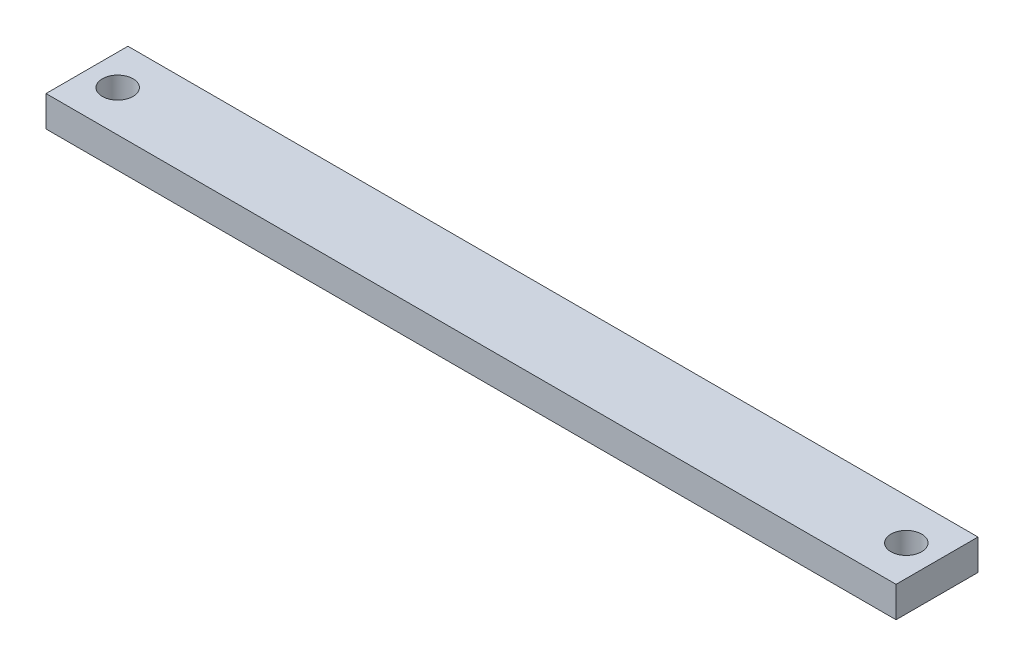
ISO-10303-21;
HEADER;
FILE_DESCRIPTION(('STEP AP214'),'2;1');
FILE_NAME('part.step','',(''),(''),'','','');
FILE_SCHEMA(('AUTOMOTIVE_DESIGN { 1 0 10303 214 1 1 1 1 }'));
ENDSEC;
DATA;
#1=APPLICATION_CONTEXT('core data for automotive mechanical design processes');
#2=APPLICATION_PROTOCOL_DEFINITION('international standard','automotive_design',2000,#1);
#3=PRODUCT_CONTEXT('',#1,'mechanical');
#4=PRODUCT('Part','Part','',(#3));
#5=PRODUCT_RELATED_PRODUCT_CATEGORY('part','',(#4));
#6=PRODUCT_DEFINITION_FORMATION('','',#4);
#7=PRODUCT_DEFINITION_CONTEXT('part definition',#1,'design');
#8=PRODUCT_DEFINITION('design','',#6,#7);
#9=PRODUCT_DEFINITION_SHAPE('','',#8);
#10=(LENGTH_UNIT() NAMED_UNIT(*) SI_UNIT(.MILLI.,.METRE.));
#11=(NAMED_UNIT(*) PLANE_ANGLE_UNIT() SI_UNIT($,.RADIAN.));
#12=(NAMED_UNIT(*) SI_UNIT($,.STERADIAN.) SOLID_ANGLE_UNIT());
#13=UNCERTAINTY_MEASURE_WITH_UNIT(LENGTH_MEASURE(1.E-05),#10,'distance_accuracy_value','');
#14=(GEOMETRIC_REPRESENTATION_CONTEXT(3) GLOBAL_UNCERTAINTY_ASSIGNED_CONTEXT((#13)) GLOBAL_UNIT_ASSIGNED_CONTEXT((#10,
#11,#12)) REPRESENTATION_CONTEXT('',''));
#15=CARTESIAN_POINT('',(0.,0.,0.));
#16=DIRECTION('',(0.,0.,1.));
#17=DIRECTION('',(1.,0.,0.));
#18=AXIS2_PLACEMENT_3D('',#15,#16,#17);
#19=CARTESIAN_POINT('',(-48.070148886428,3.,-8.));
#20=DIRECTION('',(0.,1.,0.));
#21=DIRECTION('',(0.,0.,1.));
#22=AXIS2_PLACEMENT_3D('',#19,#20,#21);
#23=PLANE('',#22);
#24=CARTESIAN_POINT('',(-45.070148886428,3.,-4.));
#25=DIRECTION('',(0.,1.,0.));
#26=DIRECTION('',(0.,0.,1.));
#27=AXIS2_PLACEMENT_3D('',#24,#25,#26);
#28=CIRCLE('',#27,1.5);
#29=CARTESIAN_POINT('',(-45.070148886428,3.,-2.5));
#30=VERTEX_POINT('',#29);
#31=EDGE_CURVE('E85',#30,#30,#28,.T.);
#32=ORIENTED_EDGE('',*,*,#31,.F.);
#33=EDGE_LOOP('',(#32));
#34=FACE_BOUND('',#33,.T.);
#35=DIRECTION('',(0.,0.,1.));
#36=VECTOR('',#35,1.);
#37=CARTESIAN_POINT('',(-48.070148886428,3.,-8.));
#38=LINE('',#37,#36);
#39=CARTESIAN_POINT('',(-48.070148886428,3.,-8.));
#40=VERTEX_POINT('',#39);
#41=CARTESIAN_POINT('',(-48.070148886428,3.,0.));
#42=VERTEX_POINT('',#41);
#43=EDGE_CURVE('E95',#40,#42,#38,.T.);
#44=ORIENTED_EDGE('',*,*,#43,.T.);
#45=DIRECTION('',(1.,0.,0.));
#46=VECTOR('',#45,1.);
#47=CARTESIAN_POINT('',(-48.070148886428,3.,0.));
#48=LINE('',#47,#46);
#49=CARTESIAN_POINT('',(34.9298511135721,3.,0.));
#50=VERTEX_POINT('',#49);
#51=EDGE_CURVE('E80',#42,#50,#48,.T.);
#52=ORIENTED_EDGE('',*,*,#51,.T.);
#53=DIRECTION('',(0.,0.,-1.));
#54=VECTOR('',#53,1.);
#55=CARTESIAN_POINT('',(34.9298511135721,3.,-8.));
#56=LINE('',#55,#54);
#57=CARTESIAN_POINT('',(34.9298511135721,3.,-8.));
#58=VERTEX_POINT('',#57);
#59=EDGE_CURVE('E46',#50,#58,#56,.T.);
#60=ORIENTED_EDGE('',*,*,#59,.T.);
#61=DIRECTION('',(-1.,0.,0.));
#62=VECTOR('',#61,1.);
#63=CARTESIAN_POINT('',(-48.070148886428,3.,-8.));
#64=LINE('',#63,#62);
#65=EDGE_CURVE('E41',#58,#40,#64,.T.);
#66=ORIENTED_EDGE('',*,*,#65,.T.);
#67=EDGE_LOOP('',(#44,#52,#60,#66));
#68=FACE_BOUND('',#67,.T.);
#69=CARTESIAN_POINT('',(31.929851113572,3.,-4.));
#70=DIRECTION('',(0.,1.,0.));
#71=DIRECTION('',(0.,0.,1.));
#72=AXIS2_PLACEMENT_3D('',#69,#70,#71);
#73=CIRCLE('',#72,1.5);
#74=CARTESIAN_POINT('',(31.929851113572,3.,-2.5));
#75=VERTEX_POINT('',#74);
#76=EDGE_CURVE('E113',#75,#75,#73,.T.);
#77=ORIENTED_EDGE('',*,*,#76,.F.);
#78=EDGE_LOOP('',(#77));
#79=FACE_BOUND('',#78,.T.);
#80=ADVANCED_FACE('F26',(#34,#68,#79),#23,.T.);
#81=CARTESIAN_POINT('',(-48.070148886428,0.,-8.));
#82=DIRECTION('',(0.,1.,0.));
#83=DIRECTION('',(0.,0.,1.));
#84=AXIS2_PLACEMENT_3D('',#81,#82,#83);
#85=PLANE('',#84);
#86=CARTESIAN_POINT('',(-45.070148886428,0.,-4.));
#87=DIRECTION('',(0.,1.,0.));
#88=DIRECTION('',(0.,0.,1.));
#89=AXIS2_PLACEMENT_3D('',#86,#87,#88);
#90=CIRCLE('',#89,1.5);
#91=CARTESIAN_POINT('',(-45.070148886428,0.,-2.5));
#92=VERTEX_POINT('',#91);
#93=EDGE_CURVE('E88',#92,#92,#90,.T.);
#94=ORIENTED_EDGE('',*,*,#93,.T.);
#95=EDGE_LOOP('',(#94));
#96=FACE_BOUND('',#95,.T.);
#97=DIRECTION('',(0.,0.,1.));
#98=VECTOR('',#97,1.);
#99=CARTESIAN_POINT('',(-48.070148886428,0.,-8.));
#100=LINE('',#99,#98);
#101=CARTESIAN_POINT('',(-48.070148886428,0.,-8.));
#102=VERTEX_POINT('',#101);
#103=CARTESIAN_POINT('',(-48.070148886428,0.,0.));
#104=VERTEX_POINT('',#103);
#105=EDGE_CURVE('E72',#102,#104,#100,.T.);
#106=ORIENTED_EDGE('',*,*,#105,.F.);
#107=DIRECTION('',(-1.,0.,0.));
#108=VECTOR('',#107,1.);
#109=CARTESIAN_POINT('',(-48.070148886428,0.,-8.));
#110=LINE('',#109,#108);
#111=CARTESIAN_POINT('',(34.9298511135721,0.,-8.));
#112=VERTEX_POINT('',#111);
#113=EDGE_CURVE('E93',#112,#102,#110,.T.);
#114=ORIENTED_EDGE('',*,*,#113,.F.);
#115=DIRECTION('',(0.,0.,-1.));
#116=VECTOR('',#115,1.);
#117=CARTESIAN_POINT('',(34.9298511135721,0.,-8.));
#118=LINE('',#117,#116);
#119=CARTESIAN_POINT('',(34.9298511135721,0.,0.));
#120=VERTEX_POINT('',#119);
#121=EDGE_CURVE('E73',#120,#112,#118,.T.);
#122=ORIENTED_EDGE('',*,*,#121,.F.);
#123=DIRECTION('',(1.,0.,0.));
#124=VECTOR('',#123,1.);
#125=CARTESIAN_POINT('',(-48.070148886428,0.,0.));
#126=LINE('',#125,#124);
#127=EDGE_CURVE('E67',#104,#120,#126,.T.);
#128=ORIENTED_EDGE('',*,*,#127,.F.);
#129=EDGE_LOOP('',(#106,#114,#122,#128));
#130=FACE_BOUND('',#129,.T.);
#131=CARTESIAN_POINT('',(31.929851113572,0.,-4.));
#132=DIRECTION('',(0.,1.,0.));
#133=DIRECTION('',(0.,0.,1.));
#134=AXIS2_PLACEMENT_3D('',#131,#132,#133);
#135=CIRCLE('',#134,1.5);
#136=CARTESIAN_POINT('',(31.929851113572,0.,-2.5));
#137=VERTEX_POINT('',#136);
#138=EDGE_CURVE('E115',#137,#137,#135,.T.);
#139=ORIENTED_EDGE('',*,*,#138,.T.);
#140=EDGE_LOOP('',(#139));
#141=FACE_BOUND('',#140,.T.);
#142=ADVANCED_FACE('F68',(#96,#130,#141),#85,.F.);
#143=CARTESIAN_POINT('',(-48.070148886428,3.,-8.));
#144=DIRECTION('',(1.,0.,0.));
#145=DIRECTION('',(0.,0.,-1.));
#146=AXIS2_PLACEMENT_3D('',#143,#144,#145);
#147=PLANE('',#146);
#148=ORIENTED_EDGE('',*,*,#105,.T.);
#149=DIRECTION('',(0.,-1.,0.));
#150=VECTOR('',#149,1.);
#151=CARTESIAN_POINT('',(-48.070148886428,3.,0.));
#152=LINE('',#151,#150);
#153=EDGE_CURVE('E11',#42,#104,#152,.T.);
#154=ORIENTED_EDGE('',*,*,#153,.F.);
#155=ORIENTED_EDGE('',*,*,#43,.F.);
#156=DIRECTION('',(0.,-1.,0.));
#157=VECTOR('',#156,1.);
#158=CARTESIAN_POINT('',(-48.070148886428,3.,-8.));
#159=LINE('',#158,#157);
#160=EDGE_CURVE('E84',#40,#102,#159,.T.);
#161=ORIENTED_EDGE('',*,*,#160,.T.);
#162=EDGE_LOOP('',(#148,#154,#155,#161));
#163=FACE_BOUND('',#162,.T.);
#164=ADVANCED_FACE('F28',(#163),#147,.F.);
#165=CARTESIAN_POINT('',(-48.070148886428,3.,0.));
#166=DIRECTION('',(0.,0.,-1.));
#167=DIRECTION('',(-1.,0.,0.));
#168=AXIS2_PLACEMENT_3D('',#165,#166,#167);
#169=PLANE('',#168);
#170=ORIENTED_EDGE('',*,*,#127,.T.);
#171=DIRECTION('',(0.,-1.,0.));
#172=VECTOR('',#171,1.);
#173=CARTESIAN_POINT('',(34.9298511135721,3.,0.));
#174=LINE('',#173,#172);
#175=EDGE_CURVE('E34',#50,#120,#174,.T.);
#176=ORIENTED_EDGE('',*,*,#175,.F.);
#177=ORIENTED_EDGE('',*,*,#51,.F.);
#178=ORIENTED_EDGE('',*,*,#153,.T.);
#179=EDGE_LOOP('',(#170,#176,#177,#178));
#180=FACE_BOUND('',#179,.T.);
#181=ADVANCED_FACE('F79',(#180),#169,.F.);
#182=CARTESIAN_POINT('',(34.9298511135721,3.,-8.));
#183=DIRECTION('',(-1.,0.,0.));
#184=DIRECTION('',(0.,0.,1.));
#185=AXIS2_PLACEMENT_3D('',#182,#183,#184);
#186=PLANE('',#185);
#187=ORIENTED_EDGE('',*,*,#121,.T.);
#188=DIRECTION('',(0.,-1.,0.));
#189=VECTOR('',#188,1.);
#190=CARTESIAN_POINT('',(34.9298511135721,3.,-8.));
#191=LINE('',#190,#189);
#192=EDGE_CURVE('E101',#58,#112,#191,.T.);
#193=ORIENTED_EDGE('',*,*,#192,.F.);
#194=ORIENTED_EDGE('',*,*,#59,.F.);
#195=ORIENTED_EDGE('',*,*,#175,.T.);
#196=EDGE_LOOP('',(#187,#193,#194,#195));
#197=FACE_BOUND('',#196,.T.);
#198=ADVANCED_FACE('F104',(#197),#186,.F.);
#199=CARTESIAN_POINT('',(-48.070148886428,3.,-8.));
#200=DIRECTION('',(0.,0.,1.));
#201=DIRECTION('',(1.,0.,0.));
#202=AXIS2_PLACEMENT_3D('',#199,#200,#201);
#203=PLANE('',#202);
#204=ORIENTED_EDGE('',*,*,#113,.T.);
#205=ORIENTED_EDGE('',*,*,#160,.F.);
#206=ORIENTED_EDGE('',*,*,#65,.F.);
#207=ORIENTED_EDGE('',*,*,#192,.T.);
#208=EDGE_LOOP('',(#204,#205,#206,#207));
#209=FACE_BOUND('',#208,.T.);
#210=ADVANCED_FACE('F106',(#209),#203,.F.);
#211=CARTESIAN_POINT('',(-45.070148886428,3.,-4.));
#212=DIRECTION('',(0.,-1.,0.));
#213=DIRECTION('',(0.,0.,-1.));
#214=AXIS2_PLACEMENT_3D('',#211,#212,#213);
#215=CYLINDRICAL_SURFACE('',#214,1.5);
#216=ORIENTED_EDGE('',*,*,#31,.T.);
#217=EDGE_LOOP('',(#216));
#218=FACE_BOUND('',#217,.T.);
#219=ORIENTED_EDGE('',*,*,#93,.F.);
#220=EDGE_LOOP('',(#219));
#221=FACE_BOUND('',#220,.T.);
#222=ADVANCED_FACE('F124',(#218,#221),#215,.F.);
#223=CARTESIAN_POINT('',(31.929851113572,3.,-4.));
#224=DIRECTION('',(0.,-1.,0.));
#225=DIRECTION('',(0.,0.,-1.));
#226=AXIS2_PLACEMENT_3D('',#223,#224,#225);
#227=CYLINDRICAL_SURFACE('',#226,1.5);
#228=ORIENTED_EDGE('',*,*,#76,.T.);
#229=EDGE_LOOP('',(#228));
#230=FACE_BOUND('',#229,.T.);
#231=ORIENTED_EDGE('',*,*,#138,.F.);
#232=EDGE_LOOP('',(#231));
#233=FACE_BOUND('',#232,.T.);
#234=ADVANCED_FACE('F122',(#230,#233),#227,.F.);
#235=CLOSED_SHELL('',(#80,#142,#164,#181,#198,#210,#222,#234));
#236=MANIFOLD_SOLID_BREP('B2',#235);
#237=ADVANCED_BREP_SHAPE_REPRESENTATION('',(#18,#236),#14);
#238=SHAPE_DEFINITION_REPRESENTATION(#9,#237);
ENDSEC;
END-ISO-10303-21;
